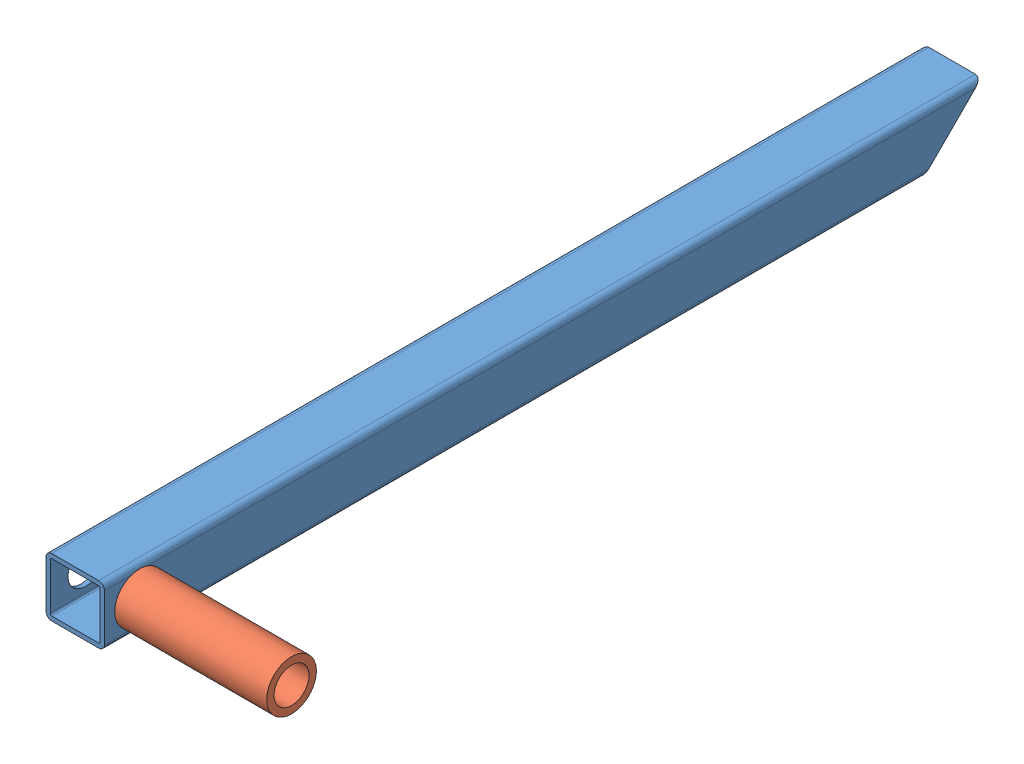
SolidWorks assembly Support vérin.SLDASM, configuration Défaut (file format 8000). Lengths in mm.
Overall size (72 20.42 300).
2 component instances, 2 part files, 2 mates.
Components (placement in the parent):
- Support vérin-1: Support vérin.SLDPRT [Défaut] at (1.0148 -11.0309 -150) size (20 20 300)
- Châpe vérin-1: Châpe vérin.SLDPRT [Défaut] at (63.0148 -1.0309 138) x (0 -0.227346 0.973814) z (-1 0 0) size (17 17 52)
Mates (geometry in assembly coordinates):
- Coaxiale1: concentric aligned: cylinder of Support vérin-1 through (-8.9852 -1.0309 138) axis (1 0 0) radius 6; cylinder of Châpe vérin-1 through (11.0148 -1.0309 138) axis (1 0 0) radius 6
- Coïncidente1: coincident anti-aligned: plane of Support vérin-1 through (11.0148 -11.0309 150) normal (1 0 0); plane of Châpe vérin-1 through (11.0148 -1.0309 138) normal (-1 0 0)
